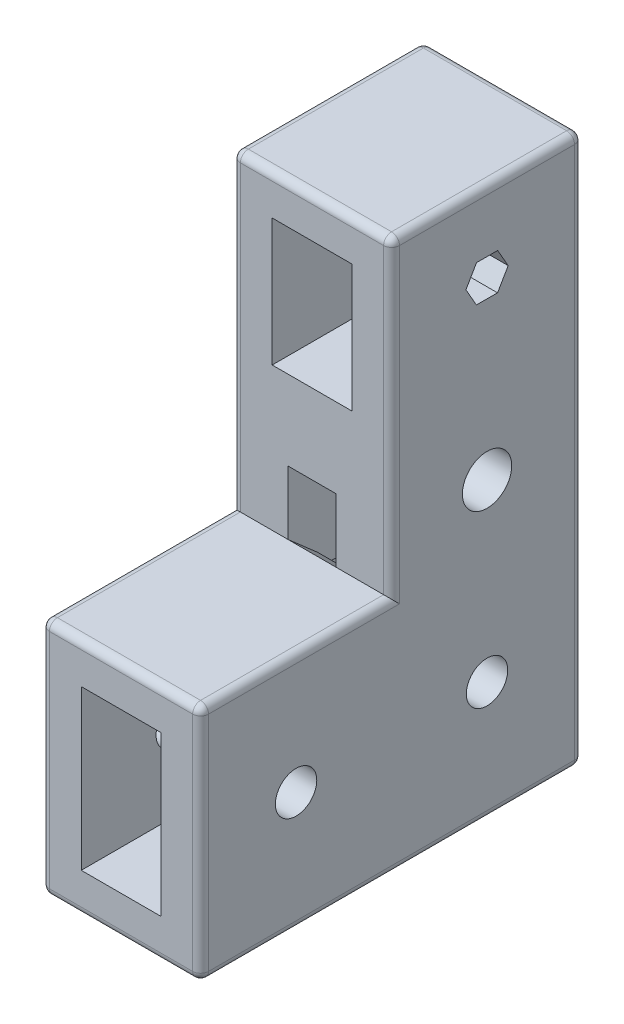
from build123d import *

# Parameters (mm, degrees)
EXTRUDE_1_DEPTH     = 20
SKETCH_2_R          = 2.6
SKETCH_2_R_2        = 3.1
CUT_EXTRUDE_1_DEPTH = 51.014853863
SKETCH_5_W          = 10
SKETCH_5_H          = 20
SKETCH_5_H_2        = 16
CUT_EXTRUDE_2_DEPTH = 63.800299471
FILLET_1_R          = 1
FILLET_2_R          = 1


with BuildPart() as part:
    # Sketch 1 → Extrude 1 (new body)
    with BuildSketch(Plane.YZ):
        Polygon((-35.211895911, 29.353159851), (-35.211895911, -18.646840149), (33.788104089, -18.646840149), (33.788104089, 5.353159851), (-5.211895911, 5.353159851), (-5.211895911, 29.353159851), align=None)
    extrude(amount=EXTRUDE_1_DEPTH)

    # Sketch 2 → Cut-Extrude 1 (cut, through all)
    with BuildSketch(Plane.YZ.offset(20)):
        with Locations(Location((-20.211895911, 17.353159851, 0), (0, 0, 270))):
            Circle(SKETCH_2_R)
        with Locations(Location((-20.211895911, -6.646840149, 0), (0, 0, 270))):
            Circle(SKETCH_2_R)
        with Locations(Location((1.788104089, -6.646840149, 0), (0, 0, 270))):
            Circle(SKETCH_2_R_2)
        Polygon((26.083302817, -7.983027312), (26.09287548, -5.327233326), (23.797676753, -3.991046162), (21.492905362, -5.310652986), (21.483332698, -7.966446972), (23.778531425, -9.302634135), align=None)
    extrude(amount=-CUT_EXTRUDE_1_DEPTH, mode=Mode.SUBTRACT)

    # Sketch 4 → Loft 1 section 0
    with BuildSketch(Plane(origin=(0, 0, -18.646840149), x_dir=(1, 0, 0), z_dir=(0, 0, -1))):
        with BuildLine():
            Line((7, 26.211895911), (13, 26.211895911))
            Line((13, 26.211895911), (13, 14.211895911))
            Line((13, 14.211895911), (7, 14.211895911))
            Line((7, 14.211895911), (7, 26.211895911))
        make_face()
    # Sketch 3 → Loft 1 section 1
    with BuildSketch(Plane.XY.offset(5.353159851)):
        with BuildLine():
            Line((7, -5.211895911), (13, -5.211895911))
            Line((13, -5.211895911), (13, 2.788104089))
            Line((13, 2.788104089), (7, 2.788104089))
            Line((7, 2.788104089), (7, -5.211895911))
        make_face()
    loft(mode=Mode.SUBTRACT)

    # Sketch 5 → Cut-Extrude 2 (cut, through all)
    with BuildSketch(Plane(origin=(0, 0, -18.646840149), x_dir=(1, 0, 0), z_dir=(0, 0, -1))):
        with Locations((10, 20.211895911)):
            Rectangle(SKETCH_5_W, SKETCH_5_H)
        with Locations((10, -20.788104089)):
            Rectangle(SKETCH_5_W, SKETCH_5_H_2)
    extrude(amount=-CUT_EXTRUDE_2_DEPTH, mode=Mode.SUBTRACT)

    # Fillet 1
    fillet_1_edges = [part.edges().sort_by_distance(p)[0] for p in [
        (10, -10.211895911, -0.361125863),
    ]]
    fillet(fillet_1_edges, radius=FILLET_1_R)

    # Fillet 2
    fillet_2_edges = [part.edges().sort_by_distance(p)[0] for p in [
        (0, -0.711895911, -18.646840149),
        (10, 33.788104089, -18.646840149),
        (0, 33.788104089, -6.646840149),
        (10, 33.788104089, 5.353159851),
        (20, 33.788104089, -6.646840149),
        (20, -0.711895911, -18.646840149),
        (20, 14.288104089, 5.353159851),
        (20, -5.211895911, 17.353159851),
        (0, -5.211895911, 17.353159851),
        (0, 14.288104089, 5.353159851),
        (10, -35.211895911, -18.646840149),
        (20, -35.211895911, 5.353159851),
        (0, -35.211895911, 5.353159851),
        (20, -20.211895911, 29.353159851),
        (10, -35.211895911, 29.353159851),
        (0, -20.211895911, 29.353159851),
        (10, -5.211895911, 29.353159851),
    ]]
    fillet(fillet_2_edges, radius=FILLET_2_R)


solid = part.part
